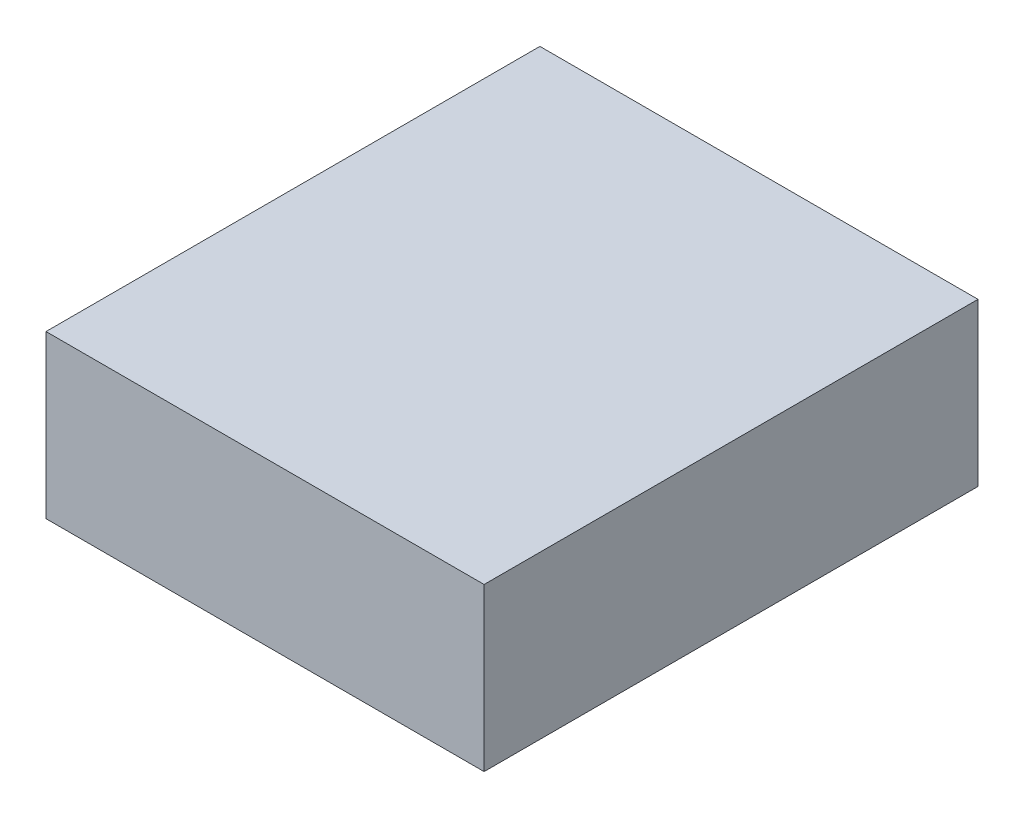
from build123d import *

# Parameters (mm, degrees)
BOSS_EXTRUDE1_DEPTH      = 140.649714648
BOSS_EXTRUDE1_DEPTH_BACK = 5
SKETCH1_W                = 129.196363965
SKETCH1_H                = 47.794776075


with BuildPart() as part:
    # Sketch1 → Boss-Extrude1 (new, two sides: drawn at the far end of the back side and taken through both)
    with BuildSketch(Plane.XY.offset(-BOSS_EXTRUDE1_DEPTH_BACK)):
        with Locations((0.889731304, 175.521421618)):
            Rectangle(SKETCH1_W, SKETCH1_H)
    extrude(amount=BOSS_EXTRUDE1_DEPTH + BOSS_EXTRUDE1_DEPTH_BACK)


solid = part.part
